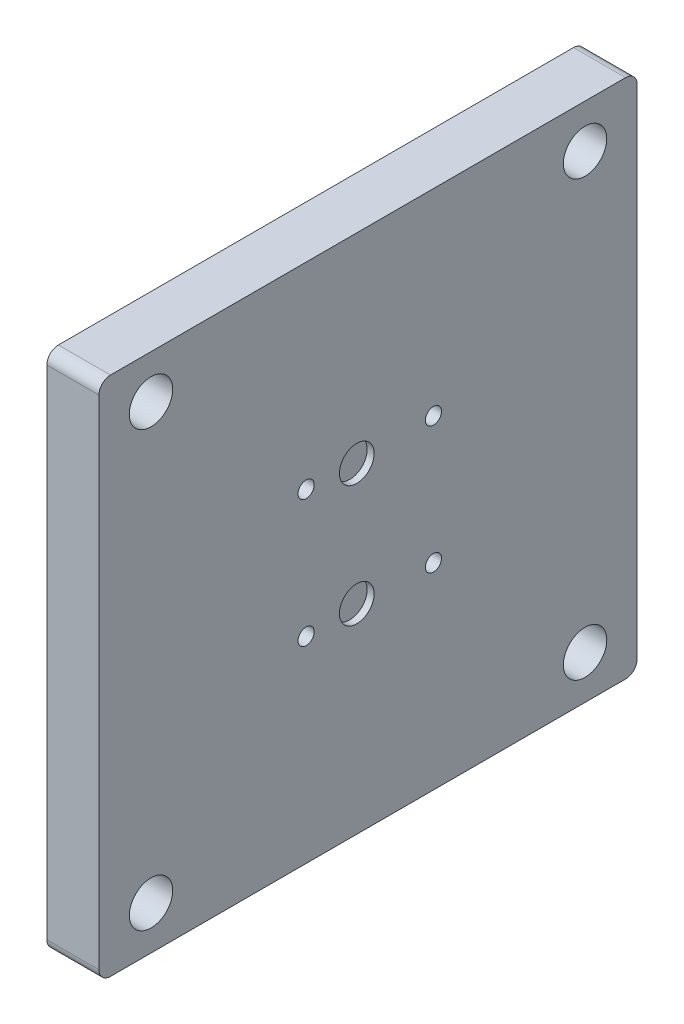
ISO-10303-21;
HEADER;
FILE_DESCRIPTION(('STEP AP214'),'2;1');
FILE_NAME('part.step','',(''),(''),'','','');
FILE_SCHEMA(('AUTOMOTIVE_DESIGN { 1 0 10303 214 1 1 1 1 }'));
ENDSEC;
DATA;
#1=APPLICATION_CONTEXT('core data for automotive mechanical design processes');
#2=APPLICATION_PROTOCOL_DEFINITION('international standard','automotive_design',2000,#1);
#3=PRODUCT_CONTEXT('',#1,'mechanical');
#4=PRODUCT('Part','Part','',(#3));
#5=PRODUCT_RELATED_PRODUCT_CATEGORY('part','',(#4));
#6=PRODUCT_DEFINITION_FORMATION('','',#4);
#7=PRODUCT_DEFINITION_CONTEXT('part definition',#1,'design');
#8=PRODUCT_DEFINITION('design','',#6,#7);
#9=PRODUCT_DEFINITION_SHAPE('','',#8);
#10=(LENGTH_UNIT() NAMED_UNIT(*) SI_UNIT(.MILLI.,.METRE.));
#11=(NAMED_UNIT(*) PLANE_ANGLE_UNIT() SI_UNIT($,.RADIAN.));
#12=(NAMED_UNIT(*) SI_UNIT($,.STERADIAN.) SOLID_ANGLE_UNIT());
#13=UNCERTAINTY_MEASURE_WITH_UNIT(LENGTH_MEASURE(1.E-05),#10,'distance_accuracy_value','');
#14=(GEOMETRIC_REPRESENTATION_CONTEXT(3) GLOBAL_UNCERTAINTY_ASSIGNED_CONTEXT((#13)) GLOBAL_UNIT_ASSIGNED_CONTEXT((#10,
#11,#12)) REPRESENTATION_CONTEXT('',''));
#15=CARTESIAN_POINT('',(0.,0.,0.));
#16=DIRECTION('',(0.,0.,1.));
#17=DIRECTION('',(1.,0.,0.));
#18=AXIS2_PLACEMENT_3D('',#15,#16,#17);
#19=CARTESIAN_POINT('',(9.,45.,-46.5));
#20=DIRECTION('',(0.,0.,1.));
#21=DIRECTION('',(0.,-1.,0.));
#22=AXIS2_PLACEMENT_3D('',#19,#20,#21);
#23=PLANE('',#22);
#24=DIRECTION('',(0.,1.,0.));
#25=VECTOR('',#24,1.);
#26=CARTESIAN_POINT('',(0.,45.,-46.5));
#27=LINE('',#26,#25);
#28=CARTESIAN_POINT('',(0.,-43.,-46.5));
#29=VERTEX_POINT('',#28);
#30=CARTESIAN_POINT('',(0.,43.,-46.5));
#31=VERTEX_POINT('',#30);
#32=EDGE_CURVE('E188',#29,#31,#27,.T.);
#33=ORIENTED_EDGE('',*,*,#32,.T.);
#34=DIRECTION('',(-1.,0.,0.));
#35=VECTOR('',#34,1.);
#36=CARTESIAN_POINT('',(9.,43.,-46.5));
#37=LINE('',#36,#35);
#38=CARTESIAN_POINT('',(9.,43.,-46.5));
#39=VERTEX_POINT('',#38);
#40=EDGE_CURVE('E11',#31,#39,#37,.F.);
#41=ORIENTED_EDGE('',*,*,#40,.T.);
#42=DIRECTION('',(0.,1.,0.));
#43=VECTOR('',#42,1.);
#44=CARTESIAN_POINT('',(9.,45.,-46.5));
#45=LINE('',#44,#43);
#46=CARTESIAN_POINT('',(9.,-43.,-46.5));
#47=VERTEX_POINT('',#46);
#48=EDGE_CURVE('E137',#47,#39,#45,.T.);
#49=ORIENTED_EDGE('',*,*,#48,.F.);
#50=DIRECTION('',(-1.,0.,0.));
#51=VECTOR('',#50,1.);
#52=CARTESIAN_POINT('',(9.,-43.,-46.5));
#53=LINE('',#52,#51);
#54=EDGE_CURVE('E49',#47,#29,#53,.T.);
#55=ORIENTED_EDGE('',*,*,#54,.T.);
#56=EDGE_LOOP('',(#33,#41,#49,#55));
#57=FACE_BOUND('',#56,.T.);
#58=ADVANCED_FACE('F39',(#57),#23,.F.);
#59=CARTESIAN_POINT('',(9.,45.,46.5));
#60=DIRECTION('',(0.,-1.,0.));
#61=DIRECTION('',(0.,0.,-1.));
#62=AXIS2_PLACEMENT_3D('',#59,#60,#61);
#63=PLANE('',#62);
#64=DIRECTION('',(0.,0.,1.));
#65=VECTOR('',#64,1.);
#66=CARTESIAN_POINT('',(0.,45.,46.5));
#67=LINE('',#66,#65);
#68=CARTESIAN_POINT('',(0.,45.,-44.5));
#69=VERTEX_POINT('',#68);
#70=CARTESIAN_POINT('',(0.,45.,44.5));
#71=VERTEX_POINT('',#70);
#72=EDGE_CURVE('E146',#69,#71,#67,.T.);
#73=ORIENTED_EDGE('',*,*,#72,.T.);
#74=DIRECTION('',(-1.,0.,0.));
#75=VECTOR('',#74,1.);
#76=CARTESIAN_POINT('',(9.,45.,44.5));
#77=LINE('',#76,#75);
#78=CARTESIAN_POINT('',(9.,45.,44.5));
#79=VERTEX_POINT('',#78);
#80=EDGE_CURVE('E57',#71,#79,#77,.F.);
#81=ORIENTED_EDGE('',*,*,#80,.T.);
#82=DIRECTION('',(0.,0.,1.));
#83=VECTOR('',#82,1.);
#84=CARTESIAN_POINT('',(9.,45.,46.5));
#85=LINE('',#84,#83);
#86=CARTESIAN_POINT('',(9.,45.,-44.5));
#87=VERTEX_POINT('',#86);
#88=EDGE_CURVE('E143',#87,#79,#85,.T.);
#89=ORIENTED_EDGE('',*,*,#88,.F.);
#90=DIRECTION('',(-1.,0.,0.));
#91=VECTOR('',#90,1.);
#92=CARTESIAN_POINT('',(9.,45.,-44.5));
#93=LINE('',#92,#91);
#94=EDGE_CURVE('E175',#87,#69,#93,.T.);
#95=ORIENTED_EDGE('',*,*,#94,.T.);
#96=EDGE_LOOP('',(#73,#81,#89,#95));
#97=FACE_BOUND('',#96,.T.);
#98=ADVANCED_FACE('F325',(#97),#63,.F.);
#99=CARTESIAN_POINT('',(9.,45.,46.5));
#100=DIRECTION('',(0.,0.,-1.));
#101=DIRECTION('',(0.,1.,0.));
#102=AXIS2_PLACEMENT_3D('',#99,#100,#101);
#103=PLANE('',#102);
#104=DIRECTION('',(-1.,0.,0.));
#105=VECTOR('',#104,1.);
#106=CARTESIAN_POINT('',(9.,43.,46.5));
#107=LINE('',#106,#105);
#108=CARTESIAN_POINT('',(9.,43.,46.5));
#109=VERTEX_POINT('',#108);
#110=CARTESIAN_POINT('',(0.,43.,46.5));
#111=VERTEX_POINT('',#110);
#112=EDGE_CURVE('E118',#109,#111,#107,.T.);
#113=ORIENTED_EDGE('',*,*,#112,.T.);
#114=DIRECTION('',(0.,-1.,0.));
#115=VECTOR('',#114,1.);
#116=CARTESIAN_POINT('',(0.,45.,46.5));
#117=LINE('',#116,#115);
#118=CARTESIAN_POINT('',(0.,-43.,46.5));
#119=VERTEX_POINT('',#118);
#120=EDGE_CURVE('E138',#111,#119,#117,.T.);
#121=ORIENTED_EDGE('',*,*,#120,.T.);
#122=DIRECTION('',(-1.,0.,0.));
#123=VECTOR('',#122,1.);
#124=CARTESIAN_POINT('',(9.,-43.,46.5));
#125=LINE('',#124,#123);
#126=CARTESIAN_POINT('',(9.,-43.,46.5));
#127=VERTEX_POINT('',#126);
#128=EDGE_CURVE('E114',#119,#127,#125,.F.);
#129=ORIENTED_EDGE('',*,*,#128,.T.);
#130=DIRECTION('',(0.,-1.,0.));
#131=VECTOR('',#130,1.);
#132=CARTESIAN_POINT('',(9.,45.,46.5));
#133=LINE('',#132,#131);
#134=EDGE_CURVE('E315',#109,#127,#133,.T.);
#135=ORIENTED_EDGE('',*,*,#134,.F.);
#136=EDGE_LOOP('',(#113,#121,#129,#135));
#137=FACE_BOUND('',#136,.T.);
#138=ADVANCED_FACE('F335',(#137),#103,.F.);
#139=CARTESIAN_POINT('',(9.,-45.,46.5));
#140=DIRECTION('',(0.,1.,0.));
#141=DIRECTION('',(0.,0.,1.));
#142=AXIS2_PLACEMENT_3D('',#139,#140,#141);
#143=PLANE('',#142);
#144=DIRECTION('',(0.,0.,-1.));
#145=VECTOR('',#144,1.);
#146=CARTESIAN_POINT('',(9.,-45.,46.5));
#147=LINE('',#146,#145);
#148=CARTESIAN_POINT('',(9.,-45.,44.5));
#149=VERTEX_POINT('',#148);
#150=CARTESIAN_POINT('',(9.,-45.,-44.5));
#151=VERTEX_POINT('',#150);
#152=EDGE_CURVE('E128',#149,#151,#147,.T.);
#153=ORIENTED_EDGE('',*,*,#152,.F.);
#154=DIRECTION('',(-1.,0.,0.));
#155=VECTOR('',#154,1.);
#156=CARTESIAN_POINT('',(9.,-45.,44.5));
#157=LINE('',#156,#155);
#158=CARTESIAN_POINT('',(0.,-45.,44.5));
#159=VERTEX_POINT('',#158);
#160=EDGE_CURVE('E113',#149,#159,#157,.T.);
#161=ORIENTED_EDGE('',*,*,#160,.T.);
#162=DIRECTION('',(0.,0.,-1.));
#163=VECTOR('',#162,1.);
#164=CARTESIAN_POINT('',(0.,-45.,46.5));
#165=LINE('',#164,#163);
#166=CARTESIAN_POINT('',(0.,-45.,-44.5));
#167=VERTEX_POINT('',#166);
#168=EDGE_CURVE('E125',#159,#167,#165,.T.);
#169=ORIENTED_EDGE('',*,*,#168,.T.);
#170=DIRECTION('',(-1.,0.,0.));
#171=VECTOR('',#170,1.);
#172=CARTESIAN_POINT('',(9.,-45.,-44.5));
#173=LINE('',#172,#171);
#174=EDGE_CURVE('E131',#167,#151,#173,.F.);
#175=ORIENTED_EDGE('',*,*,#174,.T.);
#176=EDGE_LOOP('',(#153,#161,#169,#175));
#177=FACE_BOUND('',#176,.T.);
#178=ADVANCED_FACE('F124',(#177),#143,.F.);
#179=CARTESIAN_POINT('',(9.,0.,0.));
#180=DIRECTION('',(1.,0.,0.));
#181=DIRECTION('',(0.,0.,-1.));
#182=AXIS2_PLACEMENT_3D('',#179,#180,#181);
#183=PLANE('',#182);
#184=CARTESIAN_POINT('',(9.,-11.,-11.3));
#185=DIRECTION('',(1.,0.,0.));
#186=DIRECTION('',(0.,0.,-1.));
#187=AXIS2_PLACEMENT_3D('',#184,#185,#186);
#188=CIRCLE('',#187,1.4);
#189=CARTESIAN_POINT('',(9.,-11.,-12.7));
#190=VERTEX_POINT('',#189);
#191=EDGE_CURVE('E43',#190,#190,#188,.T.);
#192=ORIENTED_EDGE('',*,*,#191,.F.);
#193=EDGE_LOOP('',(#192));
#194=FACE_BOUND('',#193,.T.);
#195=CARTESIAN_POINT('',(9.,11.,-11.3));
#196=DIRECTION('',(1.,0.,0.));
#197=DIRECTION('',(0.,0.,-1.));
#198=AXIS2_PLACEMENT_3D('',#195,#196,#197);
#199=CIRCLE('',#198,1.4);
#200=CARTESIAN_POINT('',(9.,11.,-12.7));
#201=VERTEX_POINT('',#200);
#202=EDGE_CURVE('E219',#201,#201,#199,.T.);
#203=ORIENTED_EDGE('',*,*,#202,.F.);
#204=EDGE_LOOP('',(#203));
#205=FACE_BOUND('',#204,.T.);
#206=CARTESIAN_POINT('',(9.,-11.,10.7));
#207=DIRECTION('',(1.,0.,0.));
#208=DIRECTION('',(0.,0.,-1.));
#209=AXIS2_PLACEMENT_3D('',#206,#207,#208);
#210=CIRCLE('',#209,1.4);
#211=CARTESIAN_POINT('',(9.,-11.,9.30000000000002));
#212=VERTEX_POINT('',#211);
#213=EDGE_CURVE('E214',#212,#212,#210,.T.);
#214=ORIENTED_EDGE('',*,*,#213,.F.);
#215=EDGE_LOOP('',(#214));
#216=FACE_BOUND('',#215,.T.);
#217=CARTESIAN_POINT('',(9.,11.,10.7));
#218=DIRECTION('',(1.,0.,0.));
#219=DIRECTION('',(0.,0.,-1.));
#220=AXIS2_PLACEMENT_3D('',#217,#218,#219);
#221=CIRCLE('',#220,1.4);
#222=CARTESIAN_POINT('',(9.,11.,9.30000000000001));
#223=VERTEX_POINT('',#222);
#224=EDGE_CURVE('E208',#223,#223,#221,.T.);
#225=ORIENTED_EDGE('',*,*,#224,.F.);
#226=EDGE_LOOP('',(#225));
#227=FACE_BOUND('',#226,.T.);
#228=CARTESIAN_POINT('',(9.,-10.5,1.95000000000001));
#229=DIRECTION('',(1.,0.,0.));
#230=DIRECTION('',(0.,0.,-1.));
#231=AXIS2_PLACEMENT_3D('',#228,#229,#230);
#232=CIRCLE('',#231,3.);
#233=CARTESIAN_POINT('',(9.,-10.5,-1.04999999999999));
#234=VERTEX_POINT('',#233);
#235=EDGE_CURVE('E212',#234,#234,#232,.T.);
#236=ORIENTED_EDGE('',*,*,#235,.F.);
#237=EDGE_LOOP('',(#236));
#238=FACE_BOUND('',#237,.T.);
#239=CARTESIAN_POINT('',(9.,10.5,1.95000000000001));
#240=DIRECTION('',(1.,0.,0.));
#241=DIRECTION('',(0.,0.,-1.));
#242=AXIS2_PLACEMENT_3D('',#239,#240,#241);
#243=CIRCLE('',#242,3.);
#244=CARTESIAN_POINT('',(9.,10.5,-1.04999999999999));
#245=VERTEX_POINT('',#244);
#246=EDGE_CURVE('E264',#245,#245,#243,.T.);
#247=ORIENTED_EDGE('',*,*,#246,.F.);
#248=EDGE_LOOP('',(#247));
#249=FACE_BOUND('',#248,.T.);
#250=CARTESIAN_POINT('',(9.,37.5,37.5));
#251=DIRECTION('',(1.,0.,0.));
#252=DIRECTION('',(0.,0.,-1.));
#253=AXIS2_PLACEMENT_3D('',#250,#251,#252);
#254=CIRCLE('',#253,3.75);
#255=CARTESIAN_POINT('',(9.,37.5,33.75));
#256=VERTEX_POINT('',#255);
#257=EDGE_CURVE('E271',#256,#256,#254,.T.);
#258=ORIENTED_EDGE('',*,*,#257,.F.);
#259=EDGE_LOOP('',(#258));
#260=FACE_BOUND('',#259,.T.);
#261=CARTESIAN_POINT('',(9.,37.5,-37.5));
#262=DIRECTION('',(1.,0.,0.));
#263=DIRECTION('',(0.,0.,-1.));
#264=AXIS2_PLACEMENT_3D('',#261,#262,#263);
#265=CIRCLE('',#264,3.75);
#266=CARTESIAN_POINT('',(9.,37.5,-41.25));
#267=VERTEX_POINT('',#266);
#268=EDGE_CURVE('E206',#267,#267,#265,.T.);
#269=ORIENTED_EDGE('',*,*,#268,.F.);
#270=EDGE_LOOP('',(#269));
#271=FACE_BOUND('',#270,.T.);
#272=CARTESIAN_POINT('',(9.,-37.5,37.5));
#273=DIRECTION('',(1.,0.,0.));
#274=DIRECTION('',(0.,0.,-1.));
#275=AXIS2_PLACEMENT_3D('',#272,#273,#274);
#276=CIRCLE('',#275,3.75);
#277=CARTESIAN_POINT('',(9.,-37.5,33.75));
#278=VERTEX_POINT('',#277);
#279=EDGE_CURVE('E200',#278,#278,#276,.T.);
#280=ORIENTED_EDGE('',*,*,#279,.F.);
#281=EDGE_LOOP('',(#280));
#282=FACE_BOUND('',#281,.T.);
#283=CARTESIAN_POINT('',(9.,-37.5,-37.5));
#284=DIRECTION('',(1.,0.,0.));
#285=DIRECTION('',(0.,0.,-1.));
#286=AXIS2_PLACEMENT_3D('',#283,#284,#285);
#287=CIRCLE('',#286,3.75);
#288=CARTESIAN_POINT('',(9.,-37.5,-41.25));
#289=VERTEX_POINT('',#288);
#290=EDGE_CURVE('E194',#289,#289,#287,.T.);
#291=ORIENTED_EDGE('',*,*,#290,.F.);
#292=EDGE_LOOP('',(#291));
#293=FACE_BOUND('',#292,.T.);
#294=ORIENTED_EDGE('',*,*,#134,.T.);
#295=CARTESIAN_POINT('',(9.,-43.,44.5));
#296=DIRECTION('',(1.,0.,0.));
#297=DIRECTION('',(0.,0.,-1.));
#298=AXIS2_PLACEMENT_3D('',#295,#296,#297);
#299=CIRCLE('',#298,2.);
#300=EDGE_CURVE('E172',#127,#149,#299,.T.);
#301=ORIENTED_EDGE('',*,*,#300,.T.);
#302=ORIENTED_EDGE('',*,*,#152,.T.);
#303=CARTESIAN_POINT('',(9.,-43.,-44.5));
#304=DIRECTION('',(1.,0.,0.));
#305=DIRECTION('',(0.,0.,-1.));
#306=AXIS2_PLACEMENT_3D('',#303,#304,#305);
#307=CIRCLE('',#306,2.);
#308=EDGE_CURVE('E164',#151,#47,#307,.T.);
#309=ORIENTED_EDGE('',*,*,#308,.T.);
#310=ORIENTED_EDGE('',*,*,#48,.T.);
#311=CARTESIAN_POINT('',(9.,43.,-44.5));
#312=DIRECTION('',(1.,0.,0.));
#313=DIRECTION('',(0.,0.,-1.));
#314=AXIS2_PLACEMENT_3D('',#311,#312,#313);
#315=CIRCLE('',#314,2.);
#316=EDGE_CURVE('E64',#39,#87,#315,.T.);
#317=ORIENTED_EDGE('',*,*,#316,.T.);
#318=ORIENTED_EDGE('',*,*,#88,.T.);
#319=CARTESIAN_POINT('',(9.,43.,44.5));
#320=DIRECTION('',(1.,0.,0.));
#321=DIRECTION('',(0.,0.,-1.));
#322=AXIS2_PLACEMENT_3D('',#319,#320,#321);
#323=CIRCLE('',#322,2.);
#324=EDGE_CURVE('E169',#79,#109,#323,.T.);
#325=ORIENTED_EDGE('',*,*,#324,.T.);
#326=EDGE_LOOP('',(#294,#301,#302,#309,#310,#317,#318,#325));
#327=FACE_BOUND('',#326,.T.);
#328=ADVANCED_FACE('F333',(#194,#205,#216,#227,#238,#249,#260,#271,#282,#293,#327),#183,.T.);
#329=CARTESIAN_POINT('',(0.,0.,0.));
#330=DIRECTION('',(1.,0.,0.));
#331=DIRECTION('',(0.,0.,-1.));
#332=AXIS2_PLACEMENT_3D('',#329,#330,#331);
#333=PLANE('',#332);
#334=CARTESIAN_POINT('',(0.,-11.,-11.3));
#335=DIRECTION('',(-1.,0.,0.));
#336=DIRECTION('',(0.,0.,1.));
#337=AXIS2_PLACEMENT_3D('',#334,#335,#336);
#338=CIRCLE('',#337,3.25);
#339=CARTESIAN_POINT('',(0.,-11.,-8.04999999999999));
#340=VERTEX_POINT('',#339);
#341=EDGE_CURVE('E390',#340,#340,#338,.T.);
#342=ORIENTED_EDGE('',*,*,#341,.F.);
#343=EDGE_LOOP('',(#342));
#344=FACE_BOUND('',#343,.T.);
#345=CARTESIAN_POINT('',(0.,11.,-11.3));
#346=DIRECTION('',(-1.,0.,0.));
#347=DIRECTION('',(0.,0.,1.));
#348=AXIS2_PLACEMENT_3D('',#345,#346,#347);
#349=CIRCLE('',#348,3.25);
#350=CARTESIAN_POINT('',(0.,11.,-8.04999999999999));
#351=VERTEX_POINT('',#350);
#352=EDGE_CURVE('E240',#351,#351,#349,.T.);
#353=ORIENTED_EDGE('',*,*,#352,.F.);
#354=EDGE_LOOP('',(#353));
#355=FACE_BOUND('',#354,.T.);
#356=CARTESIAN_POINT('',(0.,-11.,10.7));
#357=DIRECTION('',(-1.,0.,0.));
#358=DIRECTION('',(0.,0.,1.));
#359=AXIS2_PLACEMENT_3D('',#356,#357,#358);
#360=CIRCLE('',#359,3.25);
#361=CARTESIAN_POINT('',(0.,-11.,13.95));
#362=VERTEX_POINT('',#361);
#363=EDGE_CURVE('E222',#362,#362,#360,.T.);
#364=ORIENTED_EDGE('',*,*,#363,.F.);
#365=EDGE_LOOP('',(#364));
#366=FACE_BOUND('',#365,.T.);
#367=CARTESIAN_POINT('',(0.,11.,10.7));
#368=DIRECTION('',(-1.,0.,0.));
#369=DIRECTION('',(0.,0.,1.));
#370=AXIS2_PLACEMENT_3D('',#367,#368,#369);
#371=CIRCLE('',#370,3.25);
#372=CARTESIAN_POINT('',(0.,11.,13.95));
#373=VERTEX_POINT('',#372);
#374=EDGE_CURVE('E217',#373,#373,#371,.T.);
#375=ORIENTED_EDGE('',*,*,#374,.F.);
#376=EDGE_LOOP('',(#375));
#377=FACE_BOUND('',#376,.T.);
#378=ORIENTED_EDGE('',*,*,#120,.F.);
#379=CARTESIAN_POINT('',(0.,43.,44.5));
#380=DIRECTION('',(1.,0.,0.));
#381=DIRECTION('',(0.,0.,-1.));
#382=AXIS2_PLACEMENT_3D('',#379,#380,#381);
#383=CIRCLE('',#382,2.);
#384=EDGE_CURVE('E119',#111,#71,#383,.F.);
#385=ORIENTED_EDGE('',*,*,#384,.T.);
#386=ORIENTED_EDGE('',*,*,#72,.F.);
#387=CARTESIAN_POINT('',(0.,43.,-44.5));
#388=DIRECTION('',(1.,0.,0.));
#389=DIRECTION('',(0.,0.,-1.));
#390=AXIS2_PLACEMENT_3D('',#387,#388,#389);
#391=CIRCLE('',#390,2.);
#392=EDGE_CURVE('E154',#69,#31,#391,.F.);
#393=ORIENTED_EDGE('',*,*,#392,.T.);
#394=ORIENTED_EDGE('',*,*,#32,.F.);
#395=CARTESIAN_POINT('',(0.,-43.,-44.5));
#396=DIRECTION('',(1.,0.,0.));
#397=DIRECTION('',(0.,0.,-1.));
#398=AXIS2_PLACEMENT_3D('',#395,#396,#397);
#399=CIRCLE('',#398,2.);
#400=EDGE_CURVE('E130',#29,#167,#399,.F.);
#401=ORIENTED_EDGE('',*,*,#400,.T.);
#402=ORIENTED_EDGE('',*,*,#168,.F.);
#403=CARTESIAN_POINT('',(0.,-43.,44.5));
#404=DIRECTION('',(1.,0.,0.));
#405=DIRECTION('',(0.,0.,-1.));
#406=AXIS2_PLACEMENT_3D('',#403,#404,#405);
#407=CIRCLE('',#406,2.);
#408=EDGE_CURVE('E109',#159,#119,#407,.F.);
#409=ORIENTED_EDGE('',*,*,#408,.T.);
#410=EDGE_LOOP('',(#378,#385,#386,#393,#394,#401,#402,#409));
#411=FACE_BOUND('',#410,.T.);
#412=CARTESIAN_POINT('',(0.,37.5,37.5));
#413=DIRECTION('',(1.,0.,0.));
#414=DIRECTION('',(0.,0.,-1.));
#415=AXIS2_PLACEMENT_3D('',#412,#413,#414);
#416=CIRCLE('',#415,1.65);
#417=CARTESIAN_POINT('',(0.,37.5,35.85));
#418=VERTEX_POINT('',#417);
#419=EDGE_CURVE('E202',#418,#418,#416,.T.);
#420=ORIENTED_EDGE('',*,*,#419,.T.);
#421=EDGE_LOOP('',(#420));
#422=FACE_BOUND('',#421,.T.);
#423=CARTESIAN_POINT('',(0.,37.5,-37.5));
#424=DIRECTION('',(1.,0.,0.));
#425=DIRECTION('',(0.,0.,-1.));
#426=AXIS2_PLACEMENT_3D('',#423,#424,#425);
#427=CIRCLE('',#426,1.65);
#428=CARTESIAN_POINT('',(0.,37.5,-39.15));
#429=VERTEX_POINT('',#428);
#430=EDGE_CURVE('E196',#429,#429,#427,.T.);
#431=ORIENTED_EDGE('',*,*,#430,.T.);
#432=EDGE_LOOP('',(#431));
#433=FACE_BOUND('',#432,.T.);
#434=CARTESIAN_POINT('',(0.,-37.5,37.5));
#435=DIRECTION('',(1.,0.,0.));
#436=DIRECTION('',(0.,0.,-1.));
#437=AXIS2_PLACEMENT_3D('',#434,#435,#436);
#438=CIRCLE('',#437,1.65);
#439=CARTESIAN_POINT('',(0.,-37.5,35.85));
#440=VERTEX_POINT('',#439);
#441=EDGE_CURVE('E190',#440,#440,#438,.T.);
#442=ORIENTED_EDGE('',*,*,#441,.T.);
#443=EDGE_LOOP('',(#442));
#444=FACE_BOUND('',#443,.T.);
#445=CARTESIAN_POINT('',(0.,-37.5,-37.5));
#446=DIRECTION('',(1.,0.,0.));
#447=DIRECTION('',(0.,0.,-1.));
#448=AXIS2_PLACEMENT_3D('',#445,#446,#447);
#449=CIRCLE('',#448,1.65);
#450=CARTESIAN_POINT('',(0.,-37.5,-39.15));
#451=VERTEX_POINT('',#450);
#452=EDGE_CURVE('E184',#451,#451,#449,.T.);
#453=ORIENTED_EDGE('',*,*,#452,.T.);
#454=EDGE_LOOP('',(#453));
#455=FACE_BOUND('',#454,.T.);
#456=ADVANCED_FACE('F133',(#344,#355,#366,#377,#411,#422,#433,#444,#455),#333,.F.);
#457=CARTESIAN_POINT('',(9.,-43.,44.5));
#458=DIRECTION('',(-1.,0.,0.));
#459=DIRECTION('',(0.,0.,1.));
#460=AXIS2_PLACEMENT_3D('',#457,#458,#459);
#461=CYLINDRICAL_SURFACE('',#460,2.);
#462=ORIENTED_EDGE('',*,*,#300,.F.);
#463=ORIENTED_EDGE('',*,*,#128,.F.);
#464=ORIENTED_EDGE('',*,*,#408,.F.);
#465=ORIENTED_EDGE('',*,*,#160,.F.);
#466=EDGE_LOOP('',(#462,#463,#464,#465));
#467=FACE_BOUND('',#466,.T.);
#468=ADVANCED_FACE('F112',(#467),#461,.T.);
#469=CARTESIAN_POINT('',(9.,43.,44.5));
#470=DIRECTION('',(-1.,0.,0.));
#471=DIRECTION('',(0.,0.,1.));
#472=AXIS2_PLACEMENT_3D('',#469,#470,#471);
#473=CYLINDRICAL_SURFACE('',#472,2.);
#474=ORIENTED_EDGE('',*,*,#324,.F.);
#475=ORIENTED_EDGE('',*,*,#80,.F.);
#476=ORIENTED_EDGE('',*,*,#384,.F.);
#477=ORIENTED_EDGE('',*,*,#112,.F.);
#478=EDGE_LOOP('',(#474,#475,#476,#477));
#479=FACE_BOUND('',#478,.T.);
#480=ADVANCED_FACE('F330',(#479),#473,.T.);
#481=CARTESIAN_POINT('',(9.,43.,-44.5));
#482=DIRECTION('',(-1.,0.,0.));
#483=DIRECTION('',(0.,0.,1.));
#484=AXIS2_PLACEMENT_3D('',#481,#482,#483);
#485=CYLINDRICAL_SURFACE('',#484,2.);
#486=ORIENTED_EDGE('',*,*,#316,.F.);
#487=ORIENTED_EDGE('',*,*,#40,.F.);
#488=ORIENTED_EDGE('',*,*,#392,.F.);
#489=ORIENTED_EDGE('',*,*,#94,.F.);
#490=EDGE_LOOP('',(#486,#487,#488,#489));
#491=FACE_BOUND('',#490,.T.);
#492=ADVANCED_FACE('F353',(#491),#485,.T.);
#493=CARTESIAN_POINT('',(9.,-43.,-44.5));
#494=DIRECTION('',(-1.,0.,0.));
#495=DIRECTION('',(0.,0.,1.));
#496=AXIS2_PLACEMENT_3D('',#493,#494,#495);
#497=CYLINDRICAL_SURFACE('',#496,2.);
#498=ORIENTED_EDGE('',*,*,#308,.F.);
#499=ORIENTED_EDGE('',*,*,#174,.F.);
#500=ORIENTED_EDGE('',*,*,#400,.F.);
#501=ORIENTED_EDGE('',*,*,#54,.F.);
#502=EDGE_LOOP('',(#498,#499,#500,#501));
#503=FACE_BOUND('',#502,.T.);
#504=ADVANCED_FACE('F41',(#503),#497,.T.);
#505=CARTESIAN_POINT('',(9.,-37.5,-37.5));
#506=DIRECTION('',(1.,0.,0.));
#507=DIRECTION('',(0.,0.,-1.));
#508=AXIS2_PLACEMENT_3D('',#505,#506,#507);
#509=CYLINDRICAL_SURFACE('',#508,1.65);
#510=CARTESIAN_POINT('',(3.,-37.5,-37.5));
#511=DIRECTION('',(1.,0.,0.));
#512=DIRECTION('',(0.,0.,-1.));
#513=AXIS2_PLACEMENT_3D('',#510,#511,#512);
#514=CIRCLE('',#513,1.65);
#515=CARTESIAN_POINT('',(3.,-37.5,-39.15));
#516=VERTEX_POINT('',#515);
#517=EDGE_CURVE('E189',#516,#516,#514,.T.);
#518=ORIENTED_EDGE('',*,*,#517,.T.);
#519=EDGE_LOOP('',(#518));
#520=FACE_BOUND('',#519,.T.);
#521=ORIENTED_EDGE('',*,*,#452,.F.);
#522=EDGE_LOOP('',(#521));
#523=FACE_BOUND('',#522,.T.);
#524=ADVANCED_FACE('F359',(#520,#523),#509,.F.);
#525=CARTESIAN_POINT('',(3.,-35.85,-37.5));
#526=DIRECTION('',(-1.,0.,0.));
#527=DIRECTION('',(0.,0.,1.));
#528=AXIS2_PLACEMENT_3D('',#525,#526,#527);
#529=PLANE('',#528);
#530=ORIENTED_EDGE('',*,*,#517,.F.);
#531=EDGE_LOOP('',(#530));
#532=FACE_BOUND('',#531,.T.);
#533=CARTESIAN_POINT('',(3.,-37.5,-37.5));
#534=DIRECTION('',(1.,0.,0.));
#535=DIRECTION('',(0.,0.,-1.));
#536=AXIS2_PLACEMENT_3D('',#533,#534,#535);
#537=CIRCLE('',#536,3.75);
#538=CARTESIAN_POINT('',(3.,-37.5,-41.25));
#539=VERTEX_POINT('',#538);
#540=EDGE_CURVE('E307',#539,#539,#537,.T.);
#541=ORIENTED_EDGE('',*,*,#540,.T.);
#542=EDGE_LOOP('',(#541));
#543=FACE_BOUND('',#542,.T.);
#544=ADVANCED_FACE('F368',(#532,#543),#529,.F.);
#545=CARTESIAN_POINT('',(9.,-37.5,-37.5));
#546=DIRECTION('',(1.,0.,0.));
#547=DIRECTION('',(0.,0.,-1.));
#548=AXIS2_PLACEMENT_3D('',#545,#546,#547);
#549=CYLINDRICAL_SURFACE('',#548,3.75);
#550=ORIENTED_EDGE('',*,*,#540,.F.);
#551=EDGE_LOOP('',(#550));
#552=FACE_BOUND('',#551,.T.);
#553=ORIENTED_EDGE('',*,*,#290,.T.);
#554=EDGE_LOOP('',(#553));
#555=FACE_BOUND('',#554,.T.);
#556=ADVANCED_FACE('F374',(#552,#555),#549,.F.);
#557=CARTESIAN_POINT('',(9.,-37.5,37.5));
#558=DIRECTION('',(1.,0.,0.));
#559=DIRECTION('',(0.,0.,-1.));
#560=AXIS2_PLACEMENT_3D('',#557,#558,#559);
#561=CYLINDRICAL_SURFACE('',#560,1.65);
#562=CARTESIAN_POINT('',(3.,-37.5,37.5));
#563=DIRECTION('',(1.,0.,0.));
#564=DIRECTION('',(0.,0.,-1.));
#565=AXIS2_PLACEMENT_3D('',#562,#563,#564);
#566=CIRCLE('',#565,1.65);
#567=CARTESIAN_POINT('',(3.,-37.5,35.85));
#568=VERTEX_POINT('',#567);
#569=EDGE_CURVE('E195',#568,#568,#566,.T.);
#570=ORIENTED_EDGE('',*,*,#569,.T.);
#571=EDGE_LOOP('',(#570));
#572=FACE_BOUND('',#571,.T.);
#573=ORIENTED_EDGE('',*,*,#441,.F.);
#574=EDGE_LOOP('',(#573));
#575=FACE_BOUND('',#574,.T.);
#576=ADVANCED_FACE('F467',(#572,#575),#561,.F.);
#577=CARTESIAN_POINT('',(3.,-35.85,37.5));
#578=DIRECTION('',(-1.,0.,0.));
#579=DIRECTION('',(0.,0.,1.));
#580=AXIS2_PLACEMENT_3D('',#577,#578,#579);
#581=PLANE('',#580);
#582=ORIENTED_EDGE('',*,*,#569,.F.);
#583=EDGE_LOOP('',(#582));
#584=FACE_BOUND('',#583,.T.);
#585=CARTESIAN_POINT('',(3.,-37.5,37.5));
#586=DIRECTION('',(1.,0.,0.));
#587=DIRECTION('',(0.,0.,-1.));
#588=AXIS2_PLACEMENT_3D('',#585,#586,#587);
#589=CIRCLE('',#588,3.75);
#590=CARTESIAN_POINT('',(3.,-37.5,33.75));
#591=VERTEX_POINT('',#590);
#592=EDGE_CURVE('E297',#591,#591,#589,.T.);
#593=ORIENTED_EDGE('',*,*,#592,.T.);
#594=EDGE_LOOP('',(#593));
#595=FACE_BOUND('',#594,.T.);
#596=ADVANCED_FACE('F463',(#584,#595),#581,.F.);
#597=CARTESIAN_POINT('',(9.,-37.5,37.5));
#598=DIRECTION('',(1.,0.,0.));
#599=DIRECTION('',(0.,0.,-1.));
#600=AXIS2_PLACEMENT_3D('',#597,#598,#599);
#601=CYLINDRICAL_SURFACE('',#600,3.75);
#602=ORIENTED_EDGE('',*,*,#592,.F.);
#603=EDGE_LOOP('',(#602));
#604=FACE_BOUND('',#603,.T.);
#605=ORIENTED_EDGE('',*,*,#279,.T.);
#606=EDGE_LOOP('',(#605));
#607=FACE_BOUND('',#606,.T.);
#608=ADVANCED_FACE('F459',(#604,#607),#601,.F.);
#609=CARTESIAN_POINT('',(9.,37.5,-37.5));
#610=DIRECTION('',(1.,0.,0.));
#611=DIRECTION('',(0.,0.,-1.));
#612=AXIS2_PLACEMENT_3D('',#609,#610,#611);
#613=CYLINDRICAL_SURFACE('',#612,1.65);
#614=CARTESIAN_POINT('',(3.,37.5,-37.5));
#615=DIRECTION('',(1.,0.,0.));
#616=DIRECTION('',(0.,0.,-1.));
#617=AXIS2_PLACEMENT_3D('',#614,#615,#616);
#618=CIRCLE('',#617,1.65);
#619=CARTESIAN_POINT('',(3.,37.5,-39.15));
#620=VERTEX_POINT('',#619);
#621=EDGE_CURVE('E201',#620,#620,#618,.T.);
#622=ORIENTED_EDGE('',*,*,#621,.T.);
#623=EDGE_LOOP('',(#622));
#624=FACE_BOUND('',#623,.T.);
#625=ORIENTED_EDGE('',*,*,#430,.F.);
#626=EDGE_LOOP('',(#625));
#627=FACE_BOUND('',#626,.T.);
#628=ADVANCED_FACE('F455',(#624,#627),#613,.F.);
#629=CARTESIAN_POINT('',(3.,39.15,-37.5));
#630=DIRECTION('',(-1.,0.,0.));
#631=DIRECTION('',(0.,0.,1.));
#632=AXIS2_PLACEMENT_3D('',#629,#630,#631);
#633=PLANE('',#632);
#634=ORIENTED_EDGE('',*,*,#621,.F.);
#635=EDGE_LOOP('',(#634));
#636=FACE_BOUND('',#635,.T.);
#637=CARTESIAN_POINT('',(3.,37.5,-37.5));
#638=DIRECTION('',(1.,0.,0.));
#639=DIRECTION('',(0.,0.,-1.));
#640=AXIS2_PLACEMENT_3D('',#637,#638,#639);
#641=CIRCLE('',#640,3.75);
#642=CARTESIAN_POINT('',(3.,37.5,-41.25));
#643=VERTEX_POINT('',#642);
#644=EDGE_CURVE('E288',#643,#643,#641,.T.);
#645=ORIENTED_EDGE('',*,*,#644,.T.);
#646=EDGE_LOOP('',(#645));
#647=FACE_BOUND('',#646,.T.);
#648=ADVANCED_FACE('F451',(#636,#647),#633,.F.);
#649=CARTESIAN_POINT('',(9.,37.5,-37.5));
#650=DIRECTION('',(1.,0.,0.));
#651=DIRECTION('',(0.,0.,-1.));
#652=AXIS2_PLACEMENT_3D('',#649,#650,#651);
#653=CYLINDRICAL_SURFACE('',#652,3.75);
#654=ORIENTED_EDGE('',*,*,#644,.F.);
#655=EDGE_LOOP('',(#654));
#656=FACE_BOUND('',#655,.T.);
#657=ORIENTED_EDGE('',*,*,#268,.T.);
#658=EDGE_LOOP('',(#657));
#659=FACE_BOUND('',#658,.T.);
#660=ADVANCED_FACE('F447',(#656,#659),#653,.F.);
#661=CARTESIAN_POINT('',(9.,37.5,37.5));
#662=DIRECTION('',(1.,0.,0.));
#663=DIRECTION('',(0.,0.,-1.));
#664=AXIS2_PLACEMENT_3D('',#661,#662,#663);
#665=CYLINDRICAL_SURFACE('',#664,1.65);
#666=CARTESIAN_POINT('',(3.,37.5,37.5));
#667=DIRECTION('',(1.,0.,0.));
#668=DIRECTION('',(0.,0.,-1.));
#669=AXIS2_PLACEMENT_3D('',#666,#667,#668);
#670=CIRCLE('',#669,1.65);
#671=CARTESIAN_POINT('',(3.,37.5,35.85));
#672=VERTEX_POINT('',#671);
#673=EDGE_CURVE('E207',#672,#672,#670,.T.);
#674=ORIENTED_EDGE('',*,*,#673,.T.);
#675=EDGE_LOOP('',(#674));
#676=FACE_BOUND('',#675,.T.);
#677=ORIENTED_EDGE('',*,*,#419,.F.);
#678=EDGE_LOOP('',(#677));
#679=FACE_BOUND('',#678,.T.);
#680=ADVANCED_FACE('F443',(#676,#679),#665,.F.);
#681=CARTESIAN_POINT('',(3.,39.15,37.5));
#682=DIRECTION('',(-1.,0.,0.));
#683=DIRECTION('',(0.,0.,1.));
#684=AXIS2_PLACEMENT_3D('',#681,#682,#683);
#685=PLANE('',#684);
#686=ORIENTED_EDGE('',*,*,#673,.F.);
#687=EDGE_LOOP('',(#686));
#688=FACE_BOUND('',#687,.T.);
#689=CARTESIAN_POINT('',(3.,37.5,37.5));
#690=DIRECTION('',(1.,0.,0.));
#691=DIRECTION('',(0.,0.,-1.));
#692=AXIS2_PLACEMENT_3D('',#689,#690,#691);
#693=CIRCLE('',#692,3.75);
#694=CARTESIAN_POINT('',(3.,37.5,33.75));
#695=VERTEX_POINT('',#694);
#696=EDGE_CURVE('E278',#695,#695,#693,.T.);
#697=ORIENTED_EDGE('',*,*,#696,.T.);
#698=EDGE_LOOP('',(#697));
#699=FACE_BOUND('',#698,.T.);
#700=ADVANCED_FACE('F439',(#688,#699),#685,.F.);
#701=CARTESIAN_POINT('',(9.,37.5,37.5));
#702=DIRECTION('',(1.,0.,0.));
#703=DIRECTION('',(0.,0.,-1.));
#704=AXIS2_PLACEMENT_3D('',#701,#702,#703);
#705=CYLINDRICAL_SURFACE('',#704,3.75);
#706=ORIENTED_EDGE('',*,*,#696,.F.);
#707=EDGE_LOOP('',(#706));
#708=FACE_BOUND('',#707,.T.);
#709=ORIENTED_EDGE('',*,*,#257,.T.);
#710=EDGE_LOOP('',(#709));
#711=FACE_BOUND('',#710,.T.);
#712=ADVANCED_FACE('F435',(#708,#711),#705,.F.);
#713=CARTESIAN_POINT('',(7.8,10.5,1.95000000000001));
#714=DIRECTION('',(1.,0.,0.));
#715=DIRECTION('',(0.,0.,-1.));
#716=AXIS2_PLACEMENT_3D('',#713,#714,#715);
#717=CYLINDRICAL_SURFACE('',#716,3.);
#718=CARTESIAN_POINT('',(7.8,10.5,1.95000000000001));
#719=DIRECTION('',(1.,0.,0.));
#720=DIRECTION('',(0.,0.,-1.));
#721=AXIS2_PLACEMENT_3D('',#718,#719,#720);
#722=CIRCLE('',#721,3.);
#723=CARTESIAN_POINT('',(7.8,10.5,-1.04999999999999));
#724=VERTEX_POINT('',#723);
#725=EDGE_CURVE('E267',#724,#724,#722,.T.);
#726=ORIENTED_EDGE('',*,*,#725,.F.);
#727=EDGE_LOOP('',(#726));
#728=FACE_BOUND('',#727,.T.);
#729=ORIENTED_EDGE('',*,*,#246,.T.);
#730=EDGE_LOOP('',(#729));
#731=FACE_BOUND('',#730,.T.);
#732=ADVANCED_FACE('F431',(#728,#731),#717,.F.);
#733=CARTESIAN_POINT('',(7.8,10.5,1.95000000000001));
#734=DIRECTION('',(1.,0.,0.));
#735=DIRECTION('',(0.,0.,-1.));
#736=AXIS2_PLACEMENT_3D('',#733,#734,#735);
#737=PLANE('',#736);
#738=ORIENTED_EDGE('',*,*,#725,.T.);
#739=EDGE_LOOP('',(#738));
#740=FACE_BOUND('',#739,.T.);
#741=ADVANCED_FACE('F427',(#740),#737,.T.);
#742=CARTESIAN_POINT('',(7.8,-10.5,1.95000000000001));
#743=DIRECTION('',(1.,0.,0.));
#744=DIRECTION('',(0.,0.,-1.));
#745=AXIS2_PLACEMENT_3D('',#742,#743,#744);
#746=CYLINDRICAL_SURFACE('',#745,3.);
#747=CARTESIAN_POINT('',(7.8,-10.5,1.95000000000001));
#748=DIRECTION('',(1.,0.,0.));
#749=DIRECTION('',(0.,0.,-1.));
#750=AXIS2_PLACEMENT_3D('',#747,#748,#749);
#751=CIRCLE('',#750,3.);
#752=CARTESIAN_POINT('',(7.8,-10.5,-1.04999999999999));
#753=VERTEX_POINT('',#752);
#754=EDGE_CURVE('E260',#753,#753,#751,.T.);
#755=ORIENTED_EDGE('',*,*,#754,.F.);
#756=EDGE_LOOP('',(#755));
#757=FACE_BOUND('',#756,.T.);
#758=ORIENTED_EDGE('',*,*,#235,.T.);
#759=EDGE_LOOP('',(#758));
#760=FACE_BOUND('',#759,.T.);
#761=ADVANCED_FACE('F423',(#757,#760),#746,.F.);
#762=CARTESIAN_POINT('',(7.8,-10.5,1.95000000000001));
#763=DIRECTION('',(1.,0.,0.));
#764=DIRECTION('',(0.,0.,-1.));
#765=AXIS2_PLACEMENT_3D('',#762,#763,#764);
#766=PLANE('',#765);
#767=ORIENTED_EDGE('',*,*,#754,.T.);
#768=EDGE_LOOP('',(#767));
#769=FACE_BOUND('',#768,.T.);
#770=ADVANCED_FACE('F419',(#769),#766,.T.);
#771=CARTESIAN_POINT('',(0.,11.,10.7));
#772=DIRECTION('',(-1.,0.,0.));
#773=DIRECTION('',(0.,0.,1.));
#774=AXIS2_PLACEMENT_3D('',#771,#772,#773);
#775=CYLINDRICAL_SURFACE('',#774,1.4);
#776=ORIENTED_EDGE('',*,*,#224,.T.);
#777=EDGE_LOOP('',(#776));
#778=FACE_BOUND('',#777,.T.);
#779=CARTESIAN_POINT('',(6.,11.,10.7));
#780=DIRECTION('',(-1.,0.,0.));
#781=DIRECTION('',(0.,0.,1.));
#782=AXIS2_PLACEMENT_3D('',#779,#780,#781);
#783=CIRCLE('',#782,1.4);
#784=CARTESIAN_POINT('',(6.,11.,12.1));
#785=VERTEX_POINT('',#784);
#786=EDGE_CURVE('E213',#785,#785,#783,.T.);
#787=ORIENTED_EDGE('',*,*,#786,.T.);
#788=EDGE_LOOP('',(#787));
#789=FACE_BOUND('',#788,.T.);
#790=ADVANCED_FACE('F411',(#778,#789),#775,.F.);
#791=CARTESIAN_POINT('',(6.,12.4,10.7));
#792=DIRECTION('',(1.,0.,0.));
#793=DIRECTION('',(0.,0.,-1.));
#794=AXIS2_PLACEMENT_3D('',#791,#792,#793);
#795=PLANE('',#794);
#796=ORIENTED_EDGE('',*,*,#786,.F.);
#797=EDGE_LOOP('',(#796));
#798=FACE_BOUND('',#797,.T.);
#799=CARTESIAN_POINT('',(6.,11.,10.7));
#800=DIRECTION('',(-1.,0.,0.));
#801=DIRECTION('',(0.,0.,1.));
#802=AXIS2_PLACEMENT_3D('',#799,#800,#801);
#803=CIRCLE('',#802,3.25);
#804=CARTESIAN_POINT('',(6.,11.,13.95));
#805=VERTEX_POINT('',#804);
#806=EDGE_CURVE('E253',#805,#805,#803,.T.);
#807=ORIENTED_EDGE('',*,*,#806,.T.);
#808=EDGE_LOOP('',(#807));
#809=FACE_BOUND('',#808,.T.);
#810=ADVANCED_FACE('F401',(#798,#809),#795,.F.);
#811=CARTESIAN_POINT('',(0.,11.,10.7));
#812=DIRECTION('',(-1.,0.,0.));
#813=DIRECTION('',(0.,0.,1.));
#814=AXIS2_PLACEMENT_3D('',#811,#812,#813);
#815=CYLINDRICAL_SURFACE('',#814,3.25);
#816=ORIENTED_EDGE('',*,*,#806,.F.);
#817=EDGE_LOOP('',(#816));
#818=FACE_BOUND('',#817,.T.);
#819=ORIENTED_EDGE('',*,*,#374,.T.);
#820=EDGE_LOOP('',(#819));
#821=FACE_BOUND('',#820,.T.);
#822=ADVANCED_FACE('F398',(#818,#821),#815,.F.);
#823=CARTESIAN_POINT('',(0.,-11.,10.7));
#824=DIRECTION('',(-1.,0.,0.));
#825=DIRECTION('',(0.,0.,1.));
#826=AXIS2_PLACEMENT_3D('',#823,#824,#825);
#827=CYLINDRICAL_SURFACE('',#826,1.4);
#828=ORIENTED_EDGE('',*,*,#213,.T.);
#829=EDGE_LOOP('',(#828));
#830=FACE_BOUND('',#829,.T.);
#831=CARTESIAN_POINT('',(6.,-11.,10.7));
#832=DIRECTION('',(-1.,0.,0.));
#833=DIRECTION('',(0.,0.,1.));
#834=AXIS2_PLACEMENT_3D('',#831,#832,#833);
#835=CIRCLE('',#834,1.4);
#836=CARTESIAN_POINT('',(6.,-11.,12.1));
#837=VERTEX_POINT('',#836);
#838=EDGE_CURVE('E218',#837,#837,#835,.T.);
#839=ORIENTED_EDGE('',*,*,#838,.T.);
#840=EDGE_LOOP('',(#839));
#841=FACE_BOUND('',#840,.T.);
#842=ADVANCED_FACE('F400',(#830,#841),#827,.F.);
#843=CARTESIAN_POINT('',(6.,-9.59999999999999,10.7));
#844=DIRECTION('',(1.,0.,0.));
#845=DIRECTION('',(0.,0.,-1.));
#846=AXIS2_PLACEMENT_3D('',#843,#844,#845);
#847=PLANE('',#846);
#848=ORIENTED_EDGE('',*,*,#838,.F.);
#849=EDGE_LOOP('',(#848));
#850=FACE_BOUND('',#849,.T.);
#851=CARTESIAN_POINT('',(6.,-11.,10.7));
#852=DIRECTION('',(-1.,0.,0.));
#853=DIRECTION('',(0.,0.,1.));
#854=AXIS2_PLACEMENT_3D('',#851,#852,#853);
#855=CIRCLE('',#854,3.25);
#856=CARTESIAN_POINT('',(6.,-11.,13.95));
#857=VERTEX_POINT('',#856);
#858=EDGE_CURVE('E230',#857,#857,#855,.T.);
#859=ORIENTED_EDGE('',*,*,#858,.T.);
#860=EDGE_LOOP('',(#859));
#861=FACE_BOUND('',#860,.T.);
#862=ADVANCED_FACE('F408',(#850,#861),#847,.F.);
#863=CARTESIAN_POINT('',(0.,-11.,10.7));
#864=DIRECTION('',(-1.,0.,0.));
#865=DIRECTION('',(0.,0.,1.));
#866=AXIS2_PLACEMENT_3D('',#863,#864,#865);
#867=CYLINDRICAL_SURFACE('',#866,3.25);
#868=ORIENTED_EDGE('',*,*,#858,.F.);
#869=EDGE_LOOP('',(#868));
#870=FACE_BOUND('',#869,.T.);
#871=ORIENTED_EDGE('',*,*,#363,.T.);
#872=EDGE_LOOP('',(#871));
#873=FACE_BOUND('',#872,.T.);
#874=ADVANCED_FACE('F542',(#870,#873),#867,.F.);
#875=CARTESIAN_POINT('',(0.,11.,-11.3));
#876=DIRECTION('',(-1.,0.,0.));
#877=DIRECTION('',(0.,0.,1.));
#878=AXIS2_PLACEMENT_3D('',#875,#876,#877);
#879=CYLINDRICAL_SURFACE('',#878,1.4);
#880=ORIENTED_EDGE('',*,*,#202,.T.);
#881=EDGE_LOOP('',(#880));
#882=FACE_BOUND('',#881,.T.);
#883=CARTESIAN_POINT('',(6.,11.,-11.3));
#884=DIRECTION('',(-1.,0.,0.));
#885=DIRECTION('',(0.,0.,1.));
#886=AXIS2_PLACEMENT_3D('',#883,#884,#885);
#887=CIRCLE('',#886,1.4);
#888=CARTESIAN_POINT('',(6.,11.,-9.89999999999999));
#889=VERTEX_POINT('',#888);
#890=EDGE_CURVE('E223',#889,#889,#887,.T.);
#891=ORIENTED_EDGE('',*,*,#890,.T.);
#892=EDGE_LOOP('',(#891));
#893=FACE_BOUND('',#892,.T.);
#894=ADVANCED_FACE('F550',(#882,#893),#879,.F.);
#895=CARTESIAN_POINT('',(6.,12.4,-11.3));
#896=DIRECTION('',(1.,0.,0.));
#897=DIRECTION('',(0.,0.,-1.));
#898=AXIS2_PLACEMENT_3D('',#895,#896,#897);
#899=PLANE('',#898);
#900=ORIENTED_EDGE('',*,*,#890,.F.);
#901=EDGE_LOOP('',(#900));
#902=FACE_BOUND('',#901,.T.);
#903=CARTESIAN_POINT('',(6.,11.,-11.3));
#904=DIRECTION('',(-1.,0.,0.));
#905=DIRECTION('',(0.,0.,1.));
#906=AXIS2_PLACEMENT_3D('',#903,#904,#905);
#907=CIRCLE('',#906,3.25);
#908=CARTESIAN_POINT('',(6.,11.,-8.04999999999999));
#909=VERTEX_POINT('',#908);
#910=EDGE_CURVE('E234',#909,#909,#907,.T.);
#911=ORIENTED_EDGE('',*,*,#910,.T.);
#912=EDGE_LOOP('',(#911));
#913=FACE_BOUND('',#912,.T.);
#914=ADVANCED_FACE('F559',(#902,#913),#899,.F.);
#915=CARTESIAN_POINT('',(0.,11.,-11.3));
#916=DIRECTION('',(-1.,0.,0.));
#917=DIRECTION('',(0.,0.,1.));
#918=AXIS2_PLACEMENT_3D('',#915,#916,#917);
#919=CYLINDRICAL_SURFACE('',#918,3.25);
#920=ORIENTED_EDGE('',*,*,#910,.F.);
#921=EDGE_LOOP('',(#920));
#922=FACE_BOUND('',#921,.T.);
#923=ORIENTED_EDGE('',*,*,#352,.T.);
#924=EDGE_LOOP('',(#923));
#925=FACE_BOUND('',#924,.T.);
#926=ADVANCED_FACE('F567',(#922,#925),#919,.F.);
#927=CARTESIAN_POINT('',(0.,-11.,-11.3));
#928=DIRECTION('',(-1.,0.,0.));
#929=DIRECTION('',(0.,0.,1.));
#930=AXIS2_PLACEMENT_3D('',#927,#928,#929);
#931=CYLINDRICAL_SURFACE('',#930,1.4);
#932=ORIENTED_EDGE('',*,*,#191,.T.);
#933=EDGE_LOOP('',(#932));
#934=FACE_BOUND('',#933,.T.);
#935=CARTESIAN_POINT('',(6.,-11.,-11.3));
#936=DIRECTION('',(-1.,0.,0.));
#937=DIRECTION('',(0.,0.,1.));
#938=AXIS2_PLACEMENT_3D('',#935,#936,#937);
#939=CIRCLE('',#938,1.4);
#940=CARTESIAN_POINT('',(6.,-11.,-9.89999999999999));
#941=VERTEX_POINT('',#940);
#942=EDGE_CURVE('E774',#941,#941,#939,.T.);
#943=ORIENTED_EDGE('',*,*,#942,.T.);
#944=EDGE_LOOP('',(#943));
#945=FACE_BOUND('',#944,.T.);
#946=ADVANCED_FACE('F576',(#934,#945),#931,.F.);
#947=CARTESIAN_POINT('',(6.,-9.59999999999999,-11.3));
#948=DIRECTION('',(1.,0.,0.));
#949=DIRECTION('',(0.,0.,-1.));
#950=AXIS2_PLACEMENT_3D('',#947,#948,#949);
#951=PLANE('',#950);
#952=ORIENTED_EDGE('',*,*,#942,.F.);
#953=EDGE_LOOP('',(#952));
#954=FACE_BOUND('',#953,.T.);
#955=CARTESIAN_POINT('',(6.,-11.,-11.3));
#956=DIRECTION('',(-1.,0.,0.));
#957=DIRECTION('',(0.,0.,1.));
#958=AXIS2_PLACEMENT_3D('',#955,#956,#957);
#959=CIRCLE('',#958,3.25);
#960=CARTESIAN_POINT('',(6.,-11.,-8.04999999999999));
#961=VERTEX_POINT('',#960);
#962=EDGE_CURVE('E771',#961,#961,#959,.T.);
#963=ORIENTED_EDGE('',*,*,#962,.T.);
#964=EDGE_LOOP('',(#963));
#965=FACE_BOUND('',#964,.T.);
#966=ADVANCED_FACE('F585',(#954,#965),#951,.F.);
#967=CARTESIAN_POINT('',(0.,-11.,-11.3));
#968=DIRECTION('',(-1.,0.,0.));
#969=DIRECTION('',(0.,0.,1.));
#970=AXIS2_PLACEMENT_3D('',#967,#968,#969);
#971=CYLINDRICAL_SURFACE('',#970,3.25);
#972=ORIENTED_EDGE('',*,*,#962,.F.);
#973=EDGE_LOOP('',(#972));
#974=FACE_BOUND('',#973,.T.);
#975=ORIENTED_EDGE('',*,*,#341,.T.);
#976=EDGE_LOOP('',(#975));
#977=FACE_BOUND('',#976,.T.);
#978=ADVANCED_FACE('F594',(#974,#977),#971,.F.);
#979=CLOSED_SHELL('',(#58,#98,#138,#178,#328,#456,#468,#480,#492,#504,#524,#544,#556,#576,#596,
#608,#628,#648,#660,#680,#700,#712,#732,#741,#761,#770,#790,#810,#822,#842,#862,#874,#894,#914,
#926,#946,#966,#978));
#980=MANIFOLD_SOLID_BREP('B2',#979);
#981=ADVANCED_BREP_SHAPE_REPRESENTATION('',(#18,#980),#14);
#982=SHAPE_DEFINITION_REPRESENTATION(#9,#981);
ENDSEC;
END-ISO-10303-21;
